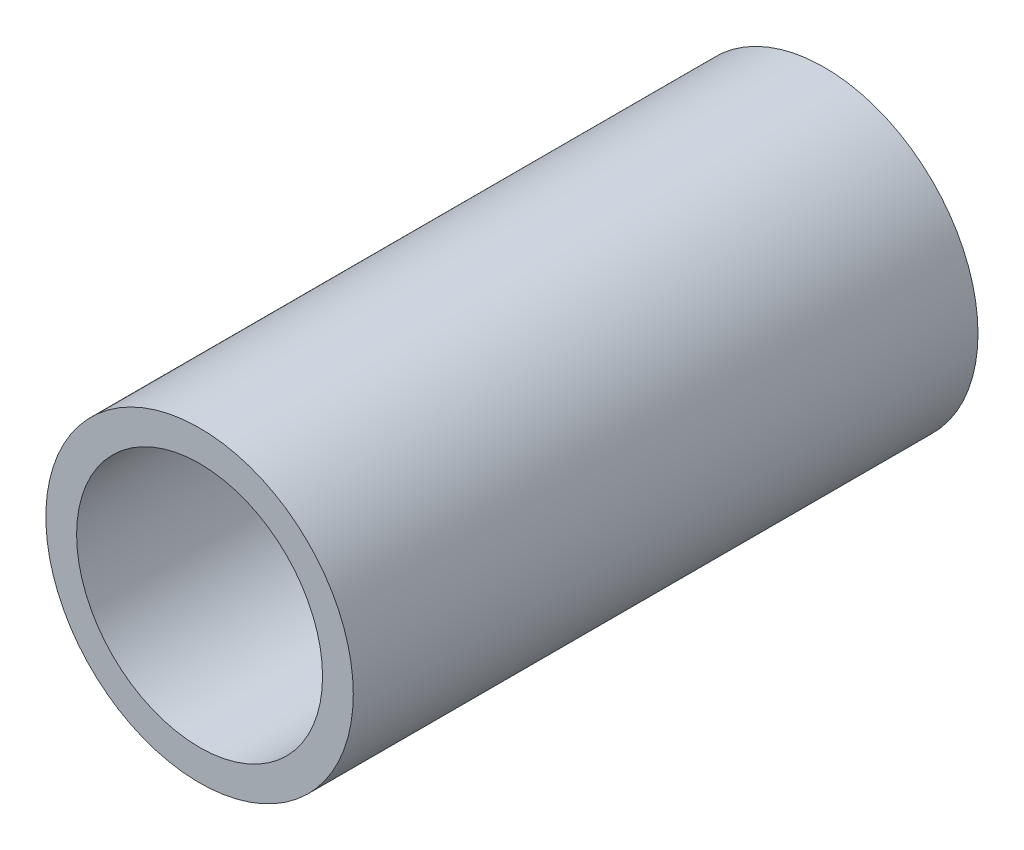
from build123d import *

# Parameters (mm, degrees)
SKETCH1_R           = 6.25
SKETCH1_R_2         = 5
BOSS_EXTRUDE1_DEPTH = 25.4


with BuildPart() as part:
    # Sketch1 → Boss-Extrude1 (new body)
    with BuildSketch(Plane.XY):
        Circle(SKETCH1_R)
        Circle(SKETCH1_R_2, mode=Mode.SUBTRACT)
    extrude(amount=BOSS_EXTRUDE1_DEPTH)


solid = part.part
